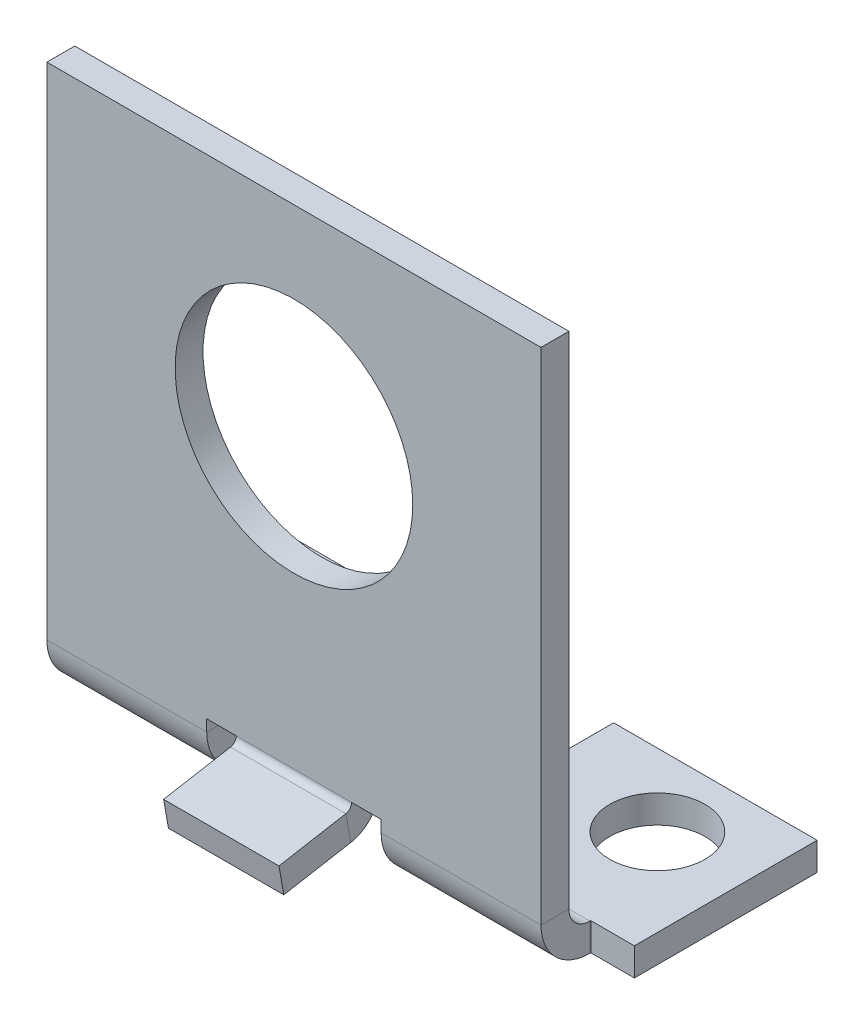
ISO-10303-21;
HEADER;
FILE_DESCRIPTION(('STEP AP214'),'2;1');
FILE_NAME('part.step','',(''),(''),'','','');
FILE_SCHEMA(('AUTOMOTIVE_DESIGN { 1 0 10303 214 1 1 1 1 }'));
ENDSEC;
DATA;
#1=APPLICATION_CONTEXT('core data for automotive mechanical design processes');
#2=APPLICATION_PROTOCOL_DEFINITION('international standard','automotive_design',2000,#1);
#3=PRODUCT_CONTEXT('',#1,'mechanical');
#4=PRODUCT('Part','Part','',(#3));
#5=PRODUCT_RELATED_PRODUCT_CATEGORY('part','',(#4));
#6=PRODUCT_DEFINITION_FORMATION('','',#4);
#7=PRODUCT_DEFINITION_CONTEXT('part definition',#1,'design');
#8=PRODUCT_DEFINITION('design','',#6,#7);
#9=PRODUCT_DEFINITION_SHAPE('','',#8);
#10=(LENGTH_UNIT() NAMED_UNIT(*) SI_UNIT(.MILLI.,.METRE.));
#11=(NAMED_UNIT(*) PLANE_ANGLE_UNIT() SI_UNIT($,.RADIAN.));
#12=(NAMED_UNIT(*) SI_UNIT($,.STERADIAN.) SOLID_ANGLE_UNIT());
#13=UNCERTAINTY_MEASURE_WITH_UNIT(LENGTH_MEASURE(1.E-05),#10,'distance_accuracy_value','');
#14=(GEOMETRIC_REPRESENTATION_CONTEXT(3) GLOBAL_UNCERTAINTY_ASSIGNED_CONTEXT((#13)) GLOBAL_UNIT_ASSIGNED_CONTEXT((#10,
#11,#12)) REPRESENTATION_CONTEXT('',''));
#15=CARTESIAN_POINT('',(0.,0.,0.));
#16=DIRECTION('',(0.,0.,1.));
#17=DIRECTION('',(1.,0.,0.));
#18=AXIS2_PLACEMENT_3D('',#15,#16,#17);
#19=CARTESIAN_POINT('',(0.,3.302,0.));
#20=DIRECTION('',(0.,1.,0.));
#21=DIRECTION('',(0.,0.,1.));
#22=AXIS2_PLACEMENT_3D('',#19,#20,#21);
#23=PLANE('',#22);
#24=DIRECTION('',(0.,0.,-1.));
#25=VECTOR('',#24,1.);
#26=CARTESIAN_POINT('',(-3.1496,3.302,0.));
#27=LINE('',#26,#25);
#28=CARTESIAN_POINT('',(-3.1496,3.302,0.));
#29=VERTEX_POINT('',#28);
#30=CARTESIAN_POINT('',(-3.1496,3.302,-1.524));
#31=VERTEX_POINT('',#30);
#32=EDGE_CURVE('E275',#29,#31,#27,.T.);
#33=ORIENTED_EDGE('',*,*,#32,.F.);
#34=DIRECTION('',(-1.,0.,0.));
#35=VECTOR('',#34,1.);
#36=CARTESIAN_POINT('',(-4.7625,3.302,0.));
#37=LINE('',#36,#35);
#38=CARTESIAN_POINT('',(-4.7625,3.302,0.));
#39=VERTEX_POINT('',#38);
#40=EDGE_CURVE('E323',#29,#39,#37,.T.);
#41=ORIENTED_EDGE('',*,*,#40,.T.);
#42=DIRECTION('',(0.,0.,-1.));
#43=VECTOR('',#42,1.);
#44=CARTESIAN_POINT('',(-4.7625,3.302,-19.05));
#45=LINE('',#44,#43);
#46=CARTESIAN_POINT('',(-4.7625,3.302,-1.52400000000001));
#47=VERTEX_POINT('',#46);
#48=EDGE_CURVE('E336',#39,#47,#45,.T.);
#49=ORIENTED_EDGE('',*,*,#48,.T.);
#50=DIRECTION('',(-1.,0.,0.));
#51=VECTOR('',#50,1.);
#52=CARTESIAN_POINT('',(13.49375,3.302,-1.524));
#53=LINE('',#52,#51);
#54=EDGE_CURVE('E325',#31,#47,#53,.T.);
#55=ORIENTED_EDGE('',*,*,#54,.F.);
#56=EDGE_LOOP('',(#33,#41,#49,#55));
#57=FACE_BOUND('',#56,.T.);
#58=ADVANCED_FACE('F54',(#57),#23,.F.);
#59=CARTESIAN_POINT('',(13.49375,2.667,-2.667));
#60=DIRECTION('',(1.,0.,0.));
#61=DIRECTION('',(0.,0.,-1.));
#62=AXIS2_PLACEMENT_3D('',#59,#60,#61);
#63=PLANE('',#62);
#64=DIRECTION('',(0.,0.,1.));
#65=VECTOR('',#64,1.);
#66=CARTESIAN_POINT('',(13.49375,0.,0.));
#67=LINE('',#66,#65);
#68=CARTESIAN_POINT('',(13.49375,0.,-2.7178));
#69=VERTEX_POINT('',#68);
#70=CARTESIAN_POINT('',(13.49375,0.,-2.667));
#71=VERTEX_POINT('',#70);
#72=EDGE_CURVE('E79',#69,#71,#67,.T.);
#73=ORIENTED_EDGE('',*,*,#72,.F.);
#74=DIRECTION('',(0.,1.,0.));
#75=VECTOR('',#74,1.);
#76=CARTESIAN_POINT('',(13.49375,0.,-2.7178));
#77=LINE('',#76,#75);
#78=CARTESIAN_POINT('',(13.49375,1.524,-2.7178));
#79=VERTEX_POINT('',#78);
#80=EDGE_CURVE('E642',#69,#79,#77,.T.);
#81=ORIENTED_EDGE('',*,*,#80,.T.);
#82=DIRECTION('',(0.,0.,-1.));
#83=VECTOR('',#82,1.);
#84=CARTESIAN_POINT('',(13.49375,1.524,0.));
#85=LINE('',#84,#83);
#86=CARTESIAN_POINT('',(13.49375,1.524,-2.667));
#87=VERTEX_POINT('',#86);
#88=EDGE_CURVE('E405',#79,#87,#85,.F.);
#89=ORIENTED_EDGE('',*,*,#88,.T.);
#90=DIRECTION('',(0.,-1.,0.));
#91=VECTOR('',#90,1.);
#92=CARTESIAN_POINT('',(13.49375,1.524,-2.667));
#93=LINE('',#92,#91);
#94=EDGE_CURVE('E461',#87,#71,#93,.T.);
#95=ORIENTED_EDGE('',*,*,#94,.T.);
#96=EDGE_LOOP('',(#73,#81,#89,#95));
#97=FACE_BOUND('',#96,.T.);
#98=ADVANCED_FACE('F544',(#97),#63,.T.);
#99=CARTESIAN_POINT('',(-4.7625,3.302,-19.05));
#100=DIRECTION('',(-1.,0.,0.));
#101=DIRECTION('',(0.,0.,1.));
#102=AXIS2_PLACEMENT_3D('',#99,#100,#101);
#103=PLANE('',#102);
#104=DIRECTION('',(0.,0.,-1.));
#105=VECTOR('',#104,1.);
#106=CARTESIAN_POINT('',(-4.7625,1.524,0.));
#107=LINE('',#106,#105);
#108=CARTESIAN_POINT('',(-4.7625,1.524,-2.667));
#109=VERTEX_POINT('',#108);
#110=CARTESIAN_POINT('',(-4.7625,1.524,-12.7));
#111=VERTEX_POINT('',#110);
#112=EDGE_CURVE('E357',#109,#111,#107,.T.);
#113=ORIENTED_EDGE('',*,*,#112,.F.);
#114=DIRECTION('',(0.,-1.,0.));
#115=VECTOR('',#114,1.);
#116=CARTESIAN_POINT('',(-4.7625,1.524,-2.667));
#117=LINE('',#116,#115);
#118=CARTESIAN_POINT('',(-4.7625,0.,-2.66700000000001));
#119=VERTEX_POINT('',#118);
#120=EDGE_CURVE('E13',#109,#119,#117,.T.);
#121=ORIENTED_EDGE('',*,*,#120,.T.);
#122=DIRECTION('',(0.,0.,-1.));
#123=VECTOR('',#122,1.);
#124=CARTESIAN_POINT('',(-4.7625,0.,-19.05));
#125=LINE('',#124,#123);
#126=CARTESIAN_POINT('',(-4.7625,0.,-12.7));
#127=VERTEX_POINT('',#126);
#128=EDGE_CURVE('E338',#119,#127,#125,.T.);
#129=ORIENTED_EDGE('',*,*,#128,.T.);
#130=DIRECTION('',(0.,1.,0.));
#131=VECTOR('',#130,1.);
#132=CARTESIAN_POINT('',(-4.7625,1.524,-12.7));
#133=LINE('',#132,#131);
#134=EDGE_CURVE('E361',#127,#111,#133,.T.);
#135=ORIENTED_EDGE('',*,*,#134,.T.);
#136=EDGE_LOOP('',(#113,#121,#129,#135));
#137=FACE_BOUND('',#136,.T.);
#138=ADVANCED_FACE('F549',(#137),#103,.F.);
#139=DIRECTION('',(0.,-1.,0.));
#140=VECTOR('',#139,1.);
#141=CARTESIAN_POINT('',(-4.7625,3.302,0.));
#142=LINE('',#141,#140);
#143=CARTESIAN_POINT('',(-4.7625,2.667,0.));
#144=VERTEX_POINT('',#143);
#145=EDGE_CURVE('E332',#39,#144,#142,.T.);
#146=ORIENTED_EDGE('',*,*,#145,.T.);
#147=DIRECTION('',(0.,0.,-1.));
#148=VECTOR('',#147,1.);
#149=CARTESIAN_POINT('',(-4.7625,2.667,0.));
#150=LINE('',#149,#148);
#151=CARTESIAN_POINT('',(-4.7625,2.667,-1.524));
#152=VERTEX_POINT('',#151);
#153=EDGE_CURVE('E63',#144,#152,#150,.T.);
#154=ORIENTED_EDGE('',*,*,#153,.T.);
#155=DIRECTION('',(0.,-1.,0.));
#156=VECTOR('',#155,1.);
#157=CARTESIAN_POINT('',(-4.7625,0.,-1.524));
#158=LINE('',#157,#156);
#159=EDGE_CURVE('E363',#47,#152,#158,.T.);
#160=ORIENTED_EDGE('',*,*,#159,.F.);
#161=ORIENTED_EDGE('',*,*,#48,.F.);
#162=EDGE_LOOP('',(#146,#154,#160,#161));
#163=FACE_BOUND('',#162,.T.);
#164=ADVANCED_FACE('F477',(#163),#103,.F.);
#165=CARTESIAN_POINT('',(4.7625,3.302,-19.05));
#166=DIRECTION('',(1.,0.,0.));
#167=DIRECTION('',(0.,0.,-1.));
#168=AXIS2_PLACEMENT_3D('',#165,#166,#167);
#169=PLANE('',#168);
#170=DIRECTION('',(0.,1.,0.));
#171=VECTOR('',#170,1.);
#172=CARTESIAN_POINT('',(4.7625,0.,-1.524));
#173=LINE('',#172,#171);
#174=CARTESIAN_POINT('',(4.7625,2.667,-1.524));
#175=VERTEX_POINT('',#174);
#176=CARTESIAN_POINT('',(4.7625,3.302,-1.524));
#177=VERTEX_POINT('',#176);
#178=EDGE_CURVE('E374',#175,#177,#173,.T.);
#179=ORIENTED_EDGE('',*,*,#178,.F.);
#180=DIRECTION('',(0.,0.,1.));
#181=VECTOR('',#180,1.);
#182=CARTESIAN_POINT('',(4.7625,2.667,-1.524));
#183=LINE('',#182,#181);
#184=CARTESIAN_POINT('',(4.7625,2.667,0.));
#185=VERTEX_POINT('',#184);
#186=EDGE_CURVE('E473',#175,#185,#183,.T.);
#187=ORIENTED_EDGE('',*,*,#186,.T.);
#188=DIRECTION('',(0.,-1.,0.));
#189=VECTOR('',#188,1.);
#190=CARTESIAN_POINT('',(4.7625,3.302,0.));
#191=LINE('',#190,#189);
#192=CARTESIAN_POINT('',(4.7625,3.302,0.));
#193=VERTEX_POINT('',#192);
#194=EDGE_CURVE('E350',#193,#185,#191,.T.);
#195=ORIENTED_EDGE('',*,*,#194,.F.);
#196=DIRECTION('',(0.,0.,1.));
#197=VECTOR('',#196,1.);
#198=CARTESIAN_POINT('',(4.7625,3.302,-19.05));
#199=LINE('',#198,#197);
#200=EDGE_CURVE('E334',#177,#193,#199,.T.);
#201=ORIENTED_EDGE('',*,*,#200,.F.);
#202=EDGE_LOOP('',(#179,#187,#195,#201));
#203=FACE_BOUND('',#202,.T.);
#204=ADVANCED_FACE('F524',(#203),#169,.F.);
#205=DIRECTION('',(0.,0.,1.));
#206=VECTOR('',#205,1.);
#207=CARTESIAN_POINT('',(4.7625,0.,-19.05));
#208=LINE('',#207,#206);
#209=CARTESIAN_POINT('',(4.7625,0.,-12.7));
#210=VERTEX_POINT('',#209);
#211=CARTESIAN_POINT('',(4.7625,0.,-2.667));
#212=VERTEX_POINT('',#211);
#213=EDGE_CURVE('E351',#210,#212,#208,.T.);
#214=ORIENTED_EDGE('',*,*,#213,.T.);
#215=DIRECTION('',(0.,1.,0.));
#216=VECTOR('',#215,1.);
#217=CARTESIAN_POINT('',(4.7625,0.,-2.667));
#218=LINE('',#217,#216);
#219=CARTESIAN_POINT('',(4.7625,1.524,-2.667));
#220=VERTEX_POINT('',#219);
#221=EDGE_CURVE('E471',#212,#220,#218,.T.);
#222=ORIENTED_EDGE('',*,*,#221,.T.);
#223=DIRECTION('',(0.,0.,1.));
#224=VECTOR('',#223,1.);
#225=CARTESIAN_POINT('',(4.7625,1.524,0.));
#226=LINE('',#225,#224);
#227=CARTESIAN_POINT('',(4.76250000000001,1.524,-12.7));
#228=VERTEX_POINT('',#227);
#229=EDGE_CURVE('E369',#228,#220,#226,.T.);
#230=ORIENTED_EDGE('',*,*,#229,.F.);
#231=DIRECTION('',(0.,-1.,0.));
#232=VECTOR('',#231,1.);
#233=CARTESIAN_POINT('',(4.7625,1.524,-12.7));
#234=LINE('',#233,#232);
#235=EDGE_CURVE('E372',#228,#210,#234,.T.);
#236=ORIENTED_EDGE('',*,*,#235,.T.);
#237=EDGE_LOOP('',(#214,#222,#230,#236));
#238=FACE_BOUND('',#237,.T.);
#239=ADVANCED_FACE('F562',(#238),#169,.F.);
#240=CARTESIAN_POINT('',(13.49375,2.667,-2.667));
#241=DIRECTION('',(-1.,0.,0.));
#242=DIRECTION('',(0.,0.,1.));
#243=AXIS2_PLACEMENT_3D('',#240,#241,#242);
#244=CYLINDRICAL_SURFACE('',#243,2.667);
#245=CARTESIAN_POINT('',(4.7625,2.667,-2.667));
#246=DIRECTION('',(1.,0.,0.));
#247=DIRECTION('',(0.,0.,-1.));
#248=AXIS2_PLACEMENT_3D('',#245,#246,#247);
#249=CIRCLE('',#248,2.667);
#250=EDGE_CURVE('E377',#212,#185,#249,.F.);
#251=ORIENTED_EDGE('',*,*,#250,.F.);
#252=DIRECTION('',(-1.,0.,0.));
#253=VECTOR('',#252,1.);
#254=CARTESIAN_POINT('',(13.49375,0.,-2.667));
#255=LINE('',#254,#253);
#256=EDGE_CURVE('E444',#71,#212,#255,.T.);
#257=ORIENTED_EDGE('',*,*,#256,.F.);
#258=CARTESIAN_POINT('',(13.49375,2.667,-2.667));
#259=DIRECTION('',(1.,0.,0.));
#260=DIRECTION('',(0.,0.,-1.));
#261=AXIS2_PLACEMENT_3D('',#258,#259,#260);
#262=CIRCLE('',#261,2.667);
#263=CARTESIAN_POINT('',(13.49375,2.667,0.));
#264=VERTEX_POINT('',#263);
#265=EDGE_CURVE('E401',#71,#264,#262,.F.);
#266=ORIENTED_EDGE('',*,*,#265,.T.);
#267=DIRECTION('',(-1.,0.,0.));
#268=VECTOR('',#267,1.);
#269=CARTESIAN_POINT('',(13.49375,2.667,0.));
#270=LINE('',#269,#268);
#271=EDGE_CURVE('E448',#264,#185,#270,.T.);
#272=ORIENTED_EDGE('',*,*,#271,.T.);
#273=EDGE_LOOP('',(#251,#257,#266,#272));
#274=FACE_BOUND('',#273,.T.);
#275=ADVANCED_FACE('F510',(#274),#244,.T.);
#276=CARTESIAN_POINT('',(13.49375,0.,0.));
#277=DIRECTION('',(0.,-1.,0.));
#278=DIRECTION('',(0.,0.,-1.));
#279=AXIS2_PLACEMENT_3D('',#276,#277,#278);
#280=PLANE('',#279);
#281=CARTESIAN_POINT('',(11.1125,0.,-8.7376));
#282=DIRECTION('',(0.,1.,0.));
#283=DIRECTION('',(0.,0.,1.));
#284=AXIS2_PLACEMENT_3D('',#281,#282,#283);
#285=CIRCLE('',#284,2.6035);
#286=CARTESIAN_POINT('',(11.1125,0.,-6.1341));
#287=VERTEX_POINT('',#286);
#288=EDGE_CURVE('E1068',#287,#287,#285,.T.);
#289=ORIENTED_EDGE('',*,*,#288,.T.);
#290=EDGE_LOOP('',(#289));
#291=FACE_BOUND('',#290,.T.);
#292=ORIENTED_EDGE('',*,*,#213,.F.);
#293=DIRECTION('',(-1.,0.,0.));
#294=VECTOR('',#293,1.);
#295=CARTESIAN_POINT('',(13.49375,0.,-12.7));
#296=LINE('',#295,#294);
#297=CARTESIAN_POINT('',(15.875,0.,-12.7));
#298=VERTEX_POINT('',#297);
#299=EDGE_CURVE('E440',#298,#210,#296,.T.);
#300=ORIENTED_EDGE('',*,*,#299,.F.);
#301=DIRECTION('',(0.,0.,1.));
#302=VECTOR('',#301,1.);
#303=CARTESIAN_POINT('',(15.875,0.,-12.7));
#304=LINE('',#303,#302);
#305=CARTESIAN_POINT('',(15.875,0.,-2.7178));
#306=VERTEX_POINT('',#305);
#307=EDGE_CURVE('E635',#298,#306,#304,.T.);
#308=ORIENTED_EDGE('',*,*,#307,.T.);
#309=DIRECTION('',(-1.,0.,0.));
#310=VECTOR('',#309,1.);
#311=CARTESIAN_POINT('',(13.49375,0.,-2.7178));
#312=LINE('',#311,#310);
#313=EDGE_CURVE('E1071',#306,#69,#312,.T.);
#314=ORIENTED_EDGE('',*,*,#313,.T.);
#315=ORIENTED_EDGE('',*,*,#72,.T.);
#316=ORIENTED_EDGE('',*,*,#256,.T.);
#317=EDGE_LOOP('',(#292,#300,#308,#314,#315,#316));
#318=FACE_BOUND('',#317,.T.);
#319=ADVANCED_FACE('F588',(#291,#318),#280,.T.);
#320=CARTESIAN_POINT('',(13.49375,1.524,-12.7));
#321=DIRECTION('',(0.,0.,-1.));
#322=DIRECTION('',(0.,1.,0.));
#323=AXIS2_PLACEMENT_3D('',#320,#321,#322);
#324=PLANE('',#323);
#325=ORIENTED_EDGE('',*,*,#235,.F.);
#326=DIRECTION('',(-1.,0.,0.));
#327=VECTOR('',#326,1.);
#328=CARTESIAN_POINT('',(13.49375,1.524,-12.7));
#329=LINE('',#328,#327);
#330=CARTESIAN_POINT('',(15.875,1.524,-12.7));
#331=VERTEX_POINT('',#330);
#332=EDGE_CURVE('E436',#331,#228,#329,.T.);
#333=ORIENTED_EDGE('',*,*,#332,.F.);
#334=DIRECTION('',(0.,1.,0.));
#335=VECTOR('',#334,1.);
#336=CARTESIAN_POINT('',(15.875,0.,-12.7));
#337=LINE('',#336,#335);
#338=EDGE_CURVE('E629',#298,#331,#337,.T.);
#339=ORIENTED_EDGE('',*,*,#338,.F.);
#340=ORIENTED_EDGE('',*,*,#299,.T.);
#341=EDGE_LOOP('',(#325,#333,#339,#340));
#342=FACE_BOUND('',#341,.T.);
#343=ADVANCED_FACE('F583',(#342),#324,.T.);
#344=CARTESIAN_POINT('',(13.49375,1.524,0.));
#345=DIRECTION('',(0.,-1.,0.));
#346=DIRECTION('',(0.,0.,-1.));
#347=AXIS2_PLACEMENT_3D('',#344,#345,#346);
#348=PLANE('',#347);
#349=CARTESIAN_POINT('',(11.1125,1.524,-8.7376));
#350=DIRECTION('',(0.,1.,0.));
#351=DIRECTION('',(0.,0.,1.));
#352=AXIS2_PLACEMENT_3D('',#349,#350,#351);
#353=CIRCLE('',#352,2.6035);
#354=CARTESIAN_POINT('',(11.1125,1.524,-6.1341));
#355=VERTEX_POINT('',#354);
#356=EDGE_CURVE('E622',#355,#355,#353,.T.);
#357=ORIENTED_EDGE('',*,*,#356,.F.);
#358=EDGE_LOOP('',(#357));
#359=FACE_BOUND('',#358,.T.);
#360=ORIENTED_EDGE('',*,*,#332,.T.);
#361=ORIENTED_EDGE('',*,*,#229,.T.);
#362=DIRECTION('',(-1.,0.,0.));
#363=VECTOR('',#362,1.);
#364=CARTESIAN_POINT('',(13.49375,1.524,-2.667));
#365=LINE('',#364,#363);
#366=EDGE_CURVE('E432',#87,#220,#365,.T.);
#367=ORIENTED_EDGE('',*,*,#366,.F.);
#368=ORIENTED_EDGE('',*,*,#88,.F.);
#369=DIRECTION('',(-1.,0.,0.));
#370=VECTOR('',#369,1.);
#371=CARTESIAN_POINT('',(13.49375,1.524,-2.7178));
#372=LINE('',#371,#370);
#373=CARTESIAN_POINT('',(15.875,1.524,-2.7178));
#374=VERTEX_POINT('',#373);
#375=EDGE_CURVE('E1074',#374,#79,#372,.T.);
#376=ORIENTED_EDGE('',*,*,#375,.F.);
#377=DIRECTION('',(0.,0.,1.));
#378=VECTOR('',#377,1.);
#379=CARTESIAN_POINT('',(15.875,1.524,-12.7));
#380=LINE('',#379,#378);
#381=EDGE_CURVE('E625',#331,#374,#380,.T.);
#382=ORIENTED_EDGE('',*,*,#381,.F.);
#383=EDGE_LOOP('',(#360,#361,#367,#368,#376,#382));
#384=FACE_BOUND('',#383,.T.);
#385=ADVANCED_FACE('F578',(#359,#384),#348,.F.);
#386=CARTESIAN_POINT('',(13.49375,2.667,-2.667));
#387=DIRECTION('',(-1.,0.,0.));
#388=DIRECTION('',(0.,0.,1.));
#389=AXIS2_PLACEMENT_3D('',#386,#387,#388);
#390=CYLINDRICAL_SURFACE('',#389,1.143);
#391=ORIENTED_EDGE('',*,*,#366,.T.);
#392=CARTESIAN_POINT('',(4.7625,2.667,-2.667));
#393=DIRECTION('',(1.,0.,0.));
#394=DIRECTION('',(0.,0.,-1.));
#395=AXIS2_PLACEMENT_3D('',#392,#393,#394);
#396=CIRCLE('',#395,1.143);
#397=EDGE_CURVE('E468',#220,#175,#396,.F.);
#398=ORIENTED_EDGE('',*,*,#397,.T.);
#399=DIRECTION('',(-1.,0.,0.));
#400=VECTOR('',#399,1.);
#401=CARTESIAN_POINT('',(13.49375,2.667,-1.524));
#402=LINE('',#401,#400);
#403=CARTESIAN_POINT('',(13.49375,2.667,-1.524));
#404=VERTEX_POINT('',#403);
#405=EDGE_CURVE('E428',#404,#175,#402,.T.);
#406=ORIENTED_EDGE('',*,*,#405,.F.);
#407=CARTESIAN_POINT('',(13.49375,2.667,-2.667));
#408=DIRECTION('',(1.,0.,0.));
#409=DIRECTION('',(0.,0.,-1.));
#410=AXIS2_PLACEMENT_3D('',#407,#408,#409);
#411=CIRCLE('',#410,1.143);
#412=EDGE_CURVE('E407',#87,#404,#411,.F.);
#413=ORIENTED_EDGE('',*,*,#412,.F.);
#414=EDGE_LOOP('',(#391,#398,#406,#413));
#415=FACE_BOUND('',#414,.T.);
#416=ADVANCED_FACE('F519',(#415),#390,.F.);
#417=CARTESIAN_POINT('',(13.49375,2.667,0.));
#418=DIRECTION('',(1.,0.,0.));
#419=DIRECTION('',(0.,0.,-1.));
#420=AXIS2_PLACEMENT_3D('',#417,#418,#419);
#421=PLANE('',#420);
#422=DIRECTION('',(0.,0.,-1.));
#423=VECTOR('',#422,1.);
#424=CARTESIAN_POINT('',(13.49375,2.667,0.));
#425=LINE('',#424,#423);
#426=EDGE_CURVE('E463',#264,#404,#425,.T.);
#427=ORIENTED_EDGE('',*,*,#426,.F.);
#428=ORIENTED_EDGE('',*,*,#265,.F.);
#429=ORIENTED_EDGE('',*,*,#94,.F.);
#430=ORIENTED_EDGE('',*,*,#412,.T.);
#431=EDGE_LOOP('',(#427,#428,#429,#430));
#432=FACE_BOUND('',#431,.T.);
#433=ADVANCED_FACE('F56',(#432),#421,.T.);
#434=CARTESIAN_POINT('',(13.49375,1.524,-2.667));
#435=DIRECTION('',(1.,0.,0.));
#436=DIRECTION('',(0.,0.,-1.));
#437=AXIS2_PLACEMENT_3D('',#434,#435,#436);
#438=PLANE('',#437);
#439=DIRECTION('',(0.,1.,0.));
#440=VECTOR('',#439,1.);
#441=CARTESIAN_POINT('',(13.49375,0.,0.));
#442=LINE('',#441,#440);
#443=CARTESIAN_POINT('',(13.49375,29.9974,0.));
#444=VERTEX_POINT('',#443);
#445=EDGE_CURVE('E398',#264,#444,#442,.T.);
#446=ORIENTED_EDGE('',*,*,#445,.F.);
#447=ORIENTED_EDGE('',*,*,#426,.T.);
#448=DIRECTION('',(0.,1.,0.));
#449=VECTOR('',#448,1.);
#450=CARTESIAN_POINT('',(13.49375,0.,-1.524));
#451=LINE('',#450,#449);
#452=CARTESIAN_POINT('',(13.49375,29.9974,-1.524));
#453=VERTEX_POINT('',#452);
#454=EDGE_CURVE('E392',#404,#453,#451,.T.);
#455=ORIENTED_EDGE('',*,*,#454,.T.);
#456=DIRECTION('',(0.,0.,-1.));
#457=VECTOR('',#456,1.);
#458=CARTESIAN_POINT('',(13.49375,29.9974,0.));
#459=LINE('',#458,#457);
#460=EDGE_CURVE('E394',#444,#453,#459,.T.);
#461=ORIENTED_EDGE('',*,*,#460,.F.);
#462=EDGE_LOOP('',(#446,#447,#455,#461));
#463=FACE_BOUND('',#462,.T.);
#464=ADVANCED_FACE('F505',(#463),#438,.T.);
#465=CARTESIAN_POINT('',(-13.49375,0.,-2.667));
#466=DIRECTION('',(-1.,0.,0.));
#467=DIRECTION('',(0.,0.,1.));
#468=AXIS2_PLACEMENT_3D('',#465,#466,#467);
#469=PLANE('',#468);
#470=DIRECTION('',(0.,1.,0.));
#471=VECTOR('',#470,1.);
#472=CARTESIAN_POINT('',(-13.49375,0.,-2.667));
#473=LINE('',#472,#471);
#474=CARTESIAN_POINT('',(-13.49375,0.,-2.667));
#475=VERTEX_POINT('',#474);
#476=CARTESIAN_POINT('',(-13.49375,1.524,-2.667));
#477=VERTEX_POINT('',#476);
#478=EDGE_CURVE('E458',#475,#477,#473,.T.);
#479=ORIENTED_EDGE('',*,*,#478,.F.);
#480=CARTESIAN_POINT('',(-13.49375,2.667,-2.667));
#481=DIRECTION('',(1.,0.,0.));
#482=DIRECTION('',(0.,0.,-1.));
#483=AXIS2_PLACEMENT_3D('',#480,#481,#482);
#484=CIRCLE('',#483,2.667);
#485=CARTESIAN_POINT('',(-13.49375,2.667,0.));
#486=VERTEX_POINT('',#485);
#487=EDGE_CURVE('E419',#475,#486,#484,.F.);
#488=ORIENTED_EDGE('',*,*,#487,.T.);
#489=DIRECTION('',(0.,0.,1.));
#490=VECTOR('',#489,1.);
#491=CARTESIAN_POINT('',(-13.49375,2.667,-1.524));
#492=LINE('',#491,#490);
#493=CARTESIAN_POINT('',(-13.49375,2.667,-1.524));
#494=VERTEX_POINT('',#493);
#495=EDGE_CURVE('E455',#494,#486,#492,.T.);
#496=ORIENTED_EDGE('',*,*,#495,.F.);
#497=CARTESIAN_POINT('',(-13.49375,2.667,-2.667));
#498=DIRECTION('',(1.,0.,0.));
#499=DIRECTION('',(0.,0.,-1.));
#500=AXIS2_PLACEMENT_3D('',#497,#498,#499);
#501=CIRCLE('',#500,1.143);
#502=EDGE_CURVE('E395',#477,#494,#501,.F.);
#503=ORIENTED_EDGE('',*,*,#502,.F.);
#504=EDGE_LOOP('',(#479,#488,#496,#503));
#505=FACE_BOUND('',#504,.T.);
#506=ADVANCED_FACE('F601',(#505),#469,.T.);
#507=CARTESIAN_POINT('',(-13.49375,2.667,-1.524));
#508=DIRECTION('',(-1.,0.,0.));
#509=DIRECTION('',(0.,0.,1.));
#510=AXIS2_PLACEMENT_3D('',#507,#508,#509);
#511=PLANE('',#510);
#512=DIRECTION('',(0.,1.,0.));
#513=VECTOR('',#512,1.);
#514=CARTESIAN_POINT('',(-13.49375,0.,-2.7178));
#515=LINE('',#514,#513);
#516=CARTESIAN_POINT('',(-13.49375,0.,-2.7178));
#517=VERTEX_POINT('',#516);
#518=CARTESIAN_POINT('',(-13.49375,1.524,-2.7178));
#519=VERTEX_POINT('',#518);
#520=EDGE_CURVE('E354',#517,#519,#515,.T.);
#521=ORIENTED_EDGE('',*,*,#520,.F.);
#522=DIRECTION('',(0.,0.,1.));
#523=VECTOR('',#522,1.);
#524=CARTESIAN_POINT('',(-13.49375,0.,0.));
#525=LINE('',#524,#523);
#526=EDGE_CURVE('E422',#517,#475,#525,.T.);
#527=ORIENTED_EDGE('',*,*,#526,.T.);
#528=ORIENTED_EDGE('',*,*,#478,.T.);
#529=DIRECTION('',(0.,0.,-1.));
#530=VECTOR('',#529,1.);
#531=CARTESIAN_POINT('',(-13.49375,1.524,0.));
#532=LINE('',#531,#530);
#533=EDGE_CURVE('E424',#519,#477,#532,.F.);
#534=ORIENTED_EDGE('',*,*,#533,.F.);
#535=EDGE_LOOP('',(#521,#527,#528,#534));
#536=FACE_BOUND('',#535,.T.);
#537=ADVANCED_FACE('F598',(#536),#511,.T.);
#538=CARTESIAN_POINT('',(13.49375,0.,-1.524));
#539=DIRECTION('',(0.,0.,1.));
#540=DIRECTION('',(1.,0.,0.));
#541=AXIS2_PLACEMENT_3D('',#538,#539,#540);
#542=PLANE('',#541);
#543=ORIENTED_EDGE('',*,*,#405,.T.);
#544=ORIENTED_EDGE('',*,*,#178,.T.);
#545=CARTESIAN_POINT('',(3.1496,3.302,-1.524));
#546=VERTEX_POINT('',#545);
#547=EDGE_CURVE('E342',#177,#546,#53,.T.);
#548=ORIENTED_EDGE('',*,*,#547,.T.);
#549=DIRECTION('',(1.,0.,0.));
#550=VECTOR('',#549,1.);
#551=CARTESIAN_POINT('',(3.1496,3.302,-1.524));
#552=LINE('',#551,#550);
#553=EDGE_CURVE('E289',#546,#31,#552,.F.);
#554=ORIENTED_EDGE('',*,*,#553,.T.);
#555=ORIENTED_EDGE('',*,*,#54,.T.);
#556=ORIENTED_EDGE('',*,*,#159,.T.);
#557=EDGE_CURVE('E410',#152,#494,#402,.T.);
#558=ORIENTED_EDGE('',*,*,#557,.T.);
#559=DIRECTION('',(0.,1.,0.));
#560=VECTOR('',#559,1.);
#561=CARTESIAN_POINT('',(-13.49375,0.,-1.524));
#562=LINE('',#561,#560);
#563=CARTESIAN_POINT('',(-13.49375,29.9974,-1.524));
#564=VERTEX_POINT('',#563);
#565=EDGE_CURVE('E390',#494,#564,#562,.T.);
#566=ORIENTED_EDGE('',*,*,#565,.T.);
#567=DIRECTION('',(-1.,0.,0.));
#568=VECTOR('',#567,1.);
#569=CARTESIAN_POINT('',(13.49375,29.9974,-1.524));
#570=LINE('',#569,#568);
#571=EDGE_CURVE('E453',#453,#564,#570,.T.);
#572=ORIENTED_EDGE('',*,*,#571,.F.);
#573=ORIENTED_EDGE('',*,*,#454,.F.);
#574=EDGE_LOOP('',(#543,#544,#548,#554,#555,#556,#558,#566,#572,#573));
#575=FACE_BOUND('',#574,.T.);
#576=CARTESIAN_POINT('',(0.,19.05,-1.524));
#577=DIRECTION('',(0.,0.,1.));
#578=DIRECTION('',(1.,0.,0.));
#579=AXIS2_PLACEMENT_3D('',#576,#577,#578);
#580=CIRCLE('',#579,6.4897);
#581=CARTESIAN_POINT('',(6.4897,19.05,-1.524));
#582=VERTEX_POINT('',#581);
#583=EDGE_CURVE('E381',#582,#582,#580,.T.);
#584=ORIENTED_EDGE('',*,*,#583,.T.);
#585=EDGE_LOOP('',(#584));
#586=FACE_BOUND('',#585,.T.);
#587=ADVANCED_FACE('F486',(#575,#586),#542,.F.);
#588=CARTESIAN_POINT('',(13.49375,29.9974,0.));
#589=DIRECTION('',(0.,1.,0.));
#590=DIRECTION('',(0.,0.,1.));
#591=AXIS2_PLACEMENT_3D('',#588,#589,#590);
#592=PLANE('',#591);
#593=DIRECTION('',(0.,0.,-1.));
#594=VECTOR('',#593,1.);
#595=CARTESIAN_POINT('',(-13.49375,29.9974,0.));
#596=LINE('',#595,#594);
#597=CARTESIAN_POINT('',(-13.49375,29.9974,0.));
#598=VERTEX_POINT('',#597);
#599=EDGE_CURVE('E413',#598,#564,#596,.T.);
#600=ORIENTED_EDGE('',*,*,#599,.F.);
#601=DIRECTION('',(-1.,0.,0.));
#602=VECTOR('',#601,1.);
#603=CARTESIAN_POINT('',(13.49375,29.9974,0.));
#604=LINE('',#603,#602);
#605=EDGE_CURVE('E451',#444,#598,#604,.T.);
#606=ORIENTED_EDGE('',*,*,#605,.F.);
#607=ORIENTED_EDGE('',*,*,#460,.T.);
#608=ORIENTED_EDGE('',*,*,#571,.T.);
#609=EDGE_LOOP('',(#600,#606,#607,#608));
#610=FACE_BOUND('',#609,.T.);
#611=ADVANCED_FACE('F502',(#610),#592,.T.);
#612=CARTESIAN_POINT('',(13.49375,0.,0.));
#613=DIRECTION('',(0.,0.,1.));
#614=DIRECTION('',(1.,0.,0.));
#615=AXIS2_PLACEMENT_3D('',#612,#613,#614);
#616=PLANE('',#615);
#617=ORIENTED_EDGE('',*,*,#194,.T.);
#618=ORIENTED_EDGE('',*,*,#271,.F.);
#619=ORIENTED_EDGE('',*,*,#445,.T.);
#620=ORIENTED_EDGE('',*,*,#605,.T.);
#621=DIRECTION('',(0.,1.,0.));
#622=VECTOR('',#621,1.);
#623=CARTESIAN_POINT('',(-13.49375,0.,0.));
#624=LINE('',#623,#622);
#625=EDGE_CURVE('E416',#486,#598,#624,.T.);
#626=ORIENTED_EDGE('',*,*,#625,.F.);
#627=EDGE_CURVE('E447',#144,#486,#270,.T.);
#628=ORIENTED_EDGE('',*,*,#627,.F.);
#629=ORIENTED_EDGE('',*,*,#145,.F.);
#630=ORIENTED_EDGE('',*,*,#40,.F.);
#631=DIRECTION('',(1.,0.,0.));
#632=VECTOR('',#631,1.);
#633=CARTESIAN_POINT('',(3.1496,3.302,0.));
#634=LINE('',#633,#632);
#635=CARTESIAN_POINT('',(3.1496,3.302,0.));
#636=VERTEX_POINT('',#635);
#637=EDGE_CURVE('E285',#636,#29,#634,.F.);
#638=ORIENTED_EDGE('',*,*,#637,.F.);
#639=EDGE_CURVE('E333',#193,#636,#37,.T.);
#640=ORIENTED_EDGE('',*,*,#639,.F.);
#641=EDGE_LOOP('',(#617,#618,#619,#620,#626,#628,#629,#630,#638,#640));
#642=FACE_BOUND('',#641,.T.);
#643=CARTESIAN_POINT('',(0.,19.05,0.));
#644=DIRECTION('',(0.,0.,1.));
#645=DIRECTION('',(1.,0.,0.));
#646=AXIS2_PLACEMENT_3D('',#643,#644,#645);
#647=CIRCLE('',#646,6.4897);
#648=CARTESIAN_POINT('',(6.4897,19.05,0.));
#649=VERTEX_POINT('',#648);
#650=EDGE_CURVE('E385',#649,#649,#647,.T.);
#651=ORIENTED_EDGE('',*,*,#650,.F.);
#652=EDGE_LOOP('',(#651));
#653=FACE_BOUND('',#652,.T.);
#654=ADVANCED_FACE('F328',(#642,#653),#616,.T.);
#655=CARTESIAN_POINT('',(-4.7625,2.667,-2.667));
#656=DIRECTION('',(-1.,0.,0.));
#657=DIRECTION('',(0.,0.,1.));
#658=AXIS2_PLACEMENT_3D('',#655,#656,#657);
#659=CIRCLE('',#658,2.667);
#660=EDGE_CURVE('E366',#144,#119,#659,.F.);
#661=ORIENTED_EDGE('',*,*,#660,.F.);
#662=ORIENTED_EDGE('',*,*,#627,.T.);
#663=ORIENTED_EDGE('',*,*,#487,.F.);
#664=EDGE_CURVE('E443',#119,#475,#255,.T.);
#665=ORIENTED_EDGE('',*,*,#664,.F.);
#666=EDGE_LOOP('',(#661,#662,#663,#665));
#667=FACE_BOUND('',#666,.T.);
#668=ADVANCED_FACE('F586',(#667),#244,.T.);
#669=CARTESIAN_POINT('',(-11.1125,0.,-8.7376));
#670=DIRECTION('',(0.,1.,0.));
#671=DIRECTION('',(0.,0.,1.));
#672=AXIS2_PLACEMENT_3D('',#669,#670,#671);
#673=CIRCLE('',#672,2.6035);
#674=CARTESIAN_POINT('',(-11.1125,0.,-6.1341));
#675=VERTEX_POINT('',#674);
#676=EDGE_CURVE('E1079',#675,#675,#673,.T.);
#677=ORIENTED_EDGE('',*,*,#676,.T.);
#678=EDGE_LOOP('',(#677));
#679=FACE_BOUND('',#678,.T.);
#680=ORIENTED_EDGE('',*,*,#128,.F.);
#681=ORIENTED_EDGE('',*,*,#664,.T.);
#682=ORIENTED_EDGE('',*,*,#526,.F.);
#683=DIRECTION('',(1.,0.,0.));
#684=VECTOR('',#683,1.);
#685=CARTESIAN_POINT('',(-13.49375,0.,-2.7178));
#686=LINE('',#685,#684);
#687=CARTESIAN_POINT('',(-15.875,0.,-2.7178));
#688=VERTEX_POINT('',#687);
#689=EDGE_CURVE('E651',#688,#517,#686,.T.);
#690=ORIENTED_EDGE('',*,*,#689,.F.);
#691=DIRECTION('',(0.,0.,1.));
#692=VECTOR('',#691,1.);
#693=CARTESIAN_POINT('',(-15.875,0.,-12.7));
#694=LINE('',#693,#692);
#695=CARTESIAN_POINT('',(-15.875,0.,-12.7));
#696=VERTEX_POINT('',#695);
#697=EDGE_CURVE('E648',#696,#688,#694,.T.);
#698=ORIENTED_EDGE('',*,*,#697,.F.);
#699=EDGE_CURVE('E439',#127,#696,#296,.T.);
#700=ORIENTED_EDGE('',*,*,#699,.F.);
#701=EDGE_LOOP('',(#680,#681,#682,#690,#698,#700));
#702=FACE_BOUND('',#701,.T.);
#703=ADVANCED_FACE('F581',(#679,#702),#280,.T.);
#704=ORIENTED_EDGE('',*,*,#134,.F.);
#705=ORIENTED_EDGE('',*,*,#699,.T.);
#706=DIRECTION('',(0.,1.,0.));
#707=VECTOR('',#706,1.);
#708=CARTESIAN_POINT('',(-15.875,0.,-12.7));
#709=LINE('',#708,#707);
#710=CARTESIAN_POINT('',(-15.875,1.524,-12.7));
#711=VERTEX_POINT('',#710);
#712=EDGE_CURVE('E652',#696,#711,#709,.T.);
#713=ORIENTED_EDGE('',*,*,#712,.T.);
#714=EDGE_CURVE('E435',#111,#711,#329,.T.);
#715=ORIENTED_EDGE('',*,*,#714,.F.);
#716=EDGE_LOOP('',(#704,#705,#713,#715));
#717=FACE_BOUND('',#716,.T.);
#718=ADVANCED_FACE('F576',(#717),#324,.T.);
#719=CARTESIAN_POINT('',(-11.1125,1.524,-8.7376));
#720=DIRECTION('',(0.,1.,0.));
#721=DIRECTION('',(0.,0.,1.));
#722=AXIS2_PLACEMENT_3D('',#719,#720,#721);
#723=CIRCLE('',#722,2.6035);
#724=CARTESIAN_POINT('',(-11.1125,1.524,-6.1341));
#725=VERTEX_POINT('',#724);
#726=EDGE_CURVE('E278',#725,#725,#723,.T.);
#727=ORIENTED_EDGE('',*,*,#726,.F.);
#728=EDGE_LOOP('',(#727));
#729=FACE_BOUND('',#728,.T.);
#730=EDGE_CURVE('E431',#109,#477,#365,.T.);
#731=ORIENTED_EDGE('',*,*,#730,.F.);
#732=ORIENTED_EDGE('',*,*,#112,.T.);
#733=ORIENTED_EDGE('',*,*,#714,.T.);
#734=DIRECTION('',(0.,0.,1.));
#735=VECTOR('',#734,1.);
#736=CARTESIAN_POINT('',(-15.875,1.524,-12.7));
#737=LINE('',#736,#735);
#738=CARTESIAN_POINT('',(-15.875,1.524,-2.7178));
#739=VERTEX_POINT('',#738);
#740=EDGE_CURVE('E636',#711,#739,#737,.T.);
#741=ORIENTED_EDGE('',*,*,#740,.T.);
#742=DIRECTION('',(1.,0.,0.));
#743=VECTOR('',#742,1.);
#744=CARTESIAN_POINT('',(-13.49375,1.524,-2.7178));
#745=LINE('',#744,#743);
#746=EDGE_CURVE('E640',#739,#519,#745,.T.);
#747=ORIENTED_EDGE('',*,*,#746,.T.);
#748=ORIENTED_EDGE('',*,*,#533,.T.);
#749=EDGE_LOOP('',(#731,#732,#733,#741,#747,#748));
#750=FACE_BOUND('',#749,.T.);
#751=ADVANCED_FACE('F573',(#729,#750),#348,.F.);
#752=ORIENTED_EDGE('',*,*,#557,.F.);
#753=CARTESIAN_POINT('',(-4.7625,2.667,-2.667));
#754=DIRECTION('',(-1.,0.,0.));
#755=DIRECTION('',(0.,0.,1.));
#756=AXIS2_PLACEMENT_3D('',#753,#754,#755);
#757=CIRCLE('',#756,1.143);
#758=EDGE_CURVE('E465',#152,#109,#757,.F.);
#759=ORIENTED_EDGE('',*,*,#758,.T.);
#760=ORIENTED_EDGE('',*,*,#730,.T.);
#761=ORIENTED_EDGE('',*,*,#502,.T.);
#762=EDGE_LOOP('',(#752,#759,#760,#761));
#763=FACE_BOUND('',#762,.T.);
#764=ADVANCED_FACE('F489',(#763),#390,.F.);
#765=CARTESIAN_POINT('',(-13.49375,2.667,-2.667));
#766=DIRECTION('',(1.,0.,0.));
#767=DIRECTION('',(0.,0.,-1.));
#768=AXIS2_PLACEMENT_3D('',#765,#766,#767);
#769=PLANE('',#768);
#770=ORIENTED_EDGE('',*,*,#565,.F.);
#771=ORIENTED_EDGE('',*,*,#495,.T.);
#772=ORIENTED_EDGE('',*,*,#625,.T.);
#773=ORIENTED_EDGE('',*,*,#599,.T.);
#774=EDGE_LOOP('',(#770,#771,#772,#773));
#775=FACE_BOUND('',#774,.T.);
#776=ADVANCED_FACE('F495',(#775),#769,.F.);
#777=CARTESIAN_POINT('',(0.,19.05,-1.524));
#778=DIRECTION('',(0.,0.,1.));
#779=DIRECTION('',(1.,0.,0.));
#780=AXIS2_PLACEMENT_3D('',#777,#778,#779);
#781=CYLINDRICAL_SURFACE('',#780,6.4897);
#782=CARTESIAN_POINT('',(6.4897,19.05,-1.524));
#783=CARTESIAN_POINT('',(6.4897,19.05,-1.508125));
#784=CARTESIAN_POINT('',(6.4897,19.05,-1.49225));
#785=CARTESIAN_POINT('',(6.4897,19.05,-1.4605));
#786=CARTESIAN_POINT('',(6.4897,19.05,-1.444625));
#787=CARTESIAN_POINT('',(6.4897,19.05,-1.412875));
#788=CARTESIAN_POINT('',(6.4897,19.05,-1.397));
#789=CARTESIAN_POINT('',(6.4897,19.05,-1.36525));
#790=CARTESIAN_POINT('',(6.4897,19.05,-1.349375));
#791=CARTESIAN_POINT('',(6.4897,19.05,-1.317625));
#792=CARTESIAN_POINT('',(6.4897,19.05,-1.30175));
#793=CARTESIAN_POINT('',(6.4897,19.05,-1.27));
#794=CARTESIAN_POINT('',(6.4897,19.05,-1.254125));
#795=CARTESIAN_POINT('',(6.4897,19.05,-1.222375));
#796=CARTESIAN_POINT('',(6.4897,19.05,-1.2065));
#797=CARTESIAN_POINT('',(6.4897,19.05,-1.17475));
#798=CARTESIAN_POINT('',(6.4897,19.05,-1.158875));
#799=CARTESIAN_POINT('',(6.4897,19.05,-1.127125));
#800=CARTESIAN_POINT('',(6.4897,19.05,-1.11125));
#801=CARTESIAN_POINT('',(6.4897,19.05,-1.0795));
#802=CARTESIAN_POINT('',(6.4897,19.05,-1.063625));
#803=CARTESIAN_POINT('',(6.4897,19.05,-1.031875));
#804=CARTESIAN_POINT('',(6.4897,19.05,-1.016));
#805=CARTESIAN_POINT('',(6.4897,19.05,-0.98425));
#806=CARTESIAN_POINT('',(6.4897,19.05,-0.968375));
#807=CARTESIAN_POINT('',(6.4897,19.05,-0.936625));
#808=CARTESIAN_POINT('',(6.4897,19.05,-0.92075));
#809=CARTESIAN_POINT('',(6.4897,19.05,-0.889));
#810=CARTESIAN_POINT('',(6.4897,19.05,-0.873125));
#811=CARTESIAN_POINT('',(6.4897,19.05,-0.841375));
#812=CARTESIAN_POINT('',(6.4897,19.05,-0.8255));
#813=CARTESIAN_POINT('',(6.4897,19.05,-0.79375));
#814=CARTESIAN_POINT('',(6.4897,19.05,-0.777875));
#815=CARTESIAN_POINT('',(6.4897,19.05,-0.746125));
#816=CARTESIAN_POINT('',(6.4897,19.05,-0.73025));
#817=CARTESIAN_POINT('',(6.4897,19.05,-0.6985));
#818=CARTESIAN_POINT('',(6.4897,19.05,-0.682625));
#819=CARTESIAN_POINT('',(6.4897,19.05,-0.650875));
#820=CARTESIAN_POINT('',(6.4897,19.05,-0.635));
#821=CARTESIAN_POINT('',(6.4897,19.05,-0.60325));
#822=CARTESIAN_POINT('',(6.4897,19.05,-0.587375));
#823=CARTESIAN_POINT('',(6.4897,19.05,-0.555625));
#824=CARTESIAN_POINT('',(6.4897,19.05,-0.53975));
#825=CARTESIAN_POINT('',(6.4897,19.05,-0.508));
#826=CARTESIAN_POINT('',(6.4897,19.05,-0.492125));
#827=CARTESIAN_POINT('',(6.4897,19.05,-0.460375));
#828=CARTESIAN_POINT('',(6.4897,19.05,-0.4445));
#829=CARTESIAN_POINT('',(6.4897,19.05,-0.41275));
#830=CARTESIAN_POINT('',(6.4897,19.05,-0.396875));
#831=CARTESIAN_POINT('',(6.4897,19.05,-0.365125));
#832=CARTESIAN_POINT('',(6.4897,19.05,-0.34925));
#833=CARTESIAN_POINT('',(6.4897,19.05,-0.3175));
#834=CARTESIAN_POINT('',(6.4897,19.05,-0.301625));
#835=CARTESIAN_POINT('',(6.4897,19.05,-0.269875));
#836=CARTESIAN_POINT('',(6.4897,19.05,-0.254));
#837=CARTESIAN_POINT('',(6.4897,19.05,-0.22225));
#838=CARTESIAN_POINT('',(6.4897,19.05,-0.206375));
#839=CARTESIAN_POINT('',(6.4897,19.05,-0.174625));
#840=CARTESIAN_POINT('',(6.4897,19.05,-0.15875));
#841=CARTESIAN_POINT('',(6.4897,19.05,-0.127));
#842=CARTESIAN_POINT('',(6.4897,19.05,-0.111125));
#843=CARTESIAN_POINT('',(6.4897,19.05,-0.079375));
#844=CARTESIAN_POINT('',(6.4897,19.05,-0.0635));
#845=CARTESIAN_POINT('',(6.4897,19.05,-0.0317499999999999));
#846=CARTESIAN_POINT('',(6.4897,19.05,-0.015875));
#847=CARTESIAN_POINT('',(6.4897,19.05,0.));
#848=B_SPLINE_CURVE_WITH_KNOTS('',3,(#782,#783,#784,#785,#786,#787,#788,#789,#790,#791,#792,
#793,#794,#795,#796,#797,#798,#799,#800,#801,#802,#803,#804,#805,#806,#807,#808,#809,#810,#811,
#812,#813,#814,#815,#816,#817,#818,#819,#820,#821,#822,#823,#824,#825,#826,#827,#828,#829,#830,
#831,#832,#833,#834,#835,#836,#837,#838,#839,#840,#841,#842,#843,#844,#845,#846,#847),
.UNSPECIFIED.,.F.,.F.,(4,2,2,2,2,2,2,2,2,2,2,2,2,2,2,2,2,2,2,2,2,2,2,2,2,2,2,2,2,2,2,2,4),(0.,
0.0476250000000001,0.0952500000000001,0.142875,0.1905,0.238125,0.28575,0.333375,0.381,0.428625,
0.47625,0.523875,0.5715,0.619125,0.66675,0.714375,0.762,0.809625,0.85725,0.904875,0.9525,
1.000125,1.04775,1.095375,1.143,1.190625,1.23825,1.285875,1.3335,1.381125,1.42875,1.476375,
1.524),.UNSPECIFIED.);
#849=EDGE_CURVE('BSEAM555',#582,#649,#848,.T.);
#850=ORIENTED_EDGE('',*,*,#583,.F.);
#851=ORIENTED_EDGE('',*,*,#650,.T.);
#852=ORIENTED_EDGE('',*,*,#849,.T.);
#853=ORIENTED_EDGE('',*,*,#849,.F.);
#854=EDGE_LOOP('',(#850,#852,#851,#853));
#855=FACE_BOUND('',#854,.T.);
#856=ADVANCED_FACE('F555',(#855),#781,.F.);
#857=ORIENTED_EDGE('',*,*,#639,.T.);
#858=DIRECTION('',(0.,0.,-1.));
#859=VECTOR('',#858,1.);
#860=CARTESIAN_POINT('',(3.1496,3.302,0.));
#861=LINE('',#860,#859);
#862=EDGE_CURVE('E279',#636,#546,#861,.T.);
#863=ORIENTED_EDGE('',*,*,#862,.T.);
#864=ORIENTED_EDGE('',*,*,#547,.F.);
#865=ORIENTED_EDGE('',*,*,#200,.T.);
#866=EDGE_LOOP('',(#857,#863,#864,#865));
#867=FACE_BOUND('',#866,.T.);
#868=ADVANCED_FACE('F526',(#867),#23,.F.);
#869=ORIENTED_EDGE('',*,*,#186,.F.);
#870=ORIENTED_EDGE('',*,*,#397,.F.);
#871=ORIENTED_EDGE('',*,*,#221,.F.);
#872=ORIENTED_EDGE('',*,*,#250,.T.);
#873=EDGE_LOOP('',(#869,#870,#871,#872));
#874=FACE_BOUND('',#873,.T.);
#875=ADVANCED_FACE('F554',(#874),#169,.F.);
#876=ORIENTED_EDGE('',*,*,#120,.F.);
#877=ORIENTED_EDGE('',*,*,#758,.F.);
#878=ORIENTED_EDGE('',*,*,#153,.F.);
#879=ORIENTED_EDGE('',*,*,#660,.T.);
#880=EDGE_LOOP('',(#876,#877,#878,#879));
#881=FACE_BOUND('',#880,.T.);
#882=ADVANCED_FACE('F480',(#881),#103,.F.);
#883=CARTESIAN_POINT('',(-13.49375,0.,-2.7178));
#884=DIRECTION('',(0.,0.,1.));
#885=DIRECTION('',(1.,0.,0.));
#886=AXIS2_PLACEMENT_3D('',#883,#884,#885);
#887=PLANE('',#886);
#888=ORIENTED_EDGE('',*,*,#746,.F.);
#889=DIRECTION('',(0.,1.,0.));
#890=VECTOR('',#889,1.);
#891=CARTESIAN_POINT('',(-15.875,0.,-2.7178));
#892=LINE('',#891,#890);
#893=EDGE_CURVE('E657',#688,#739,#892,.T.);
#894=ORIENTED_EDGE('',*,*,#893,.F.);
#895=ORIENTED_EDGE('',*,*,#689,.T.);
#896=ORIENTED_EDGE('',*,*,#520,.T.);
#897=EDGE_LOOP('',(#888,#894,#895,#896));
#898=FACE_BOUND('',#897,.T.);
#899=ADVANCED_FACE('F670',(#898),#887,.T.);
#900=CARTESIAN_POINT('',(-15.875,0.,-12.7));
#901=DIRECTION('',(-1.,0.,0.));
#902=DIRECTION('',(0.,0.,1.));
#903=AXIS2_PLACEMENT_3D('',#900,#901,#902);
#904=PLANE('',#903);
#905=ORIENTED_EDGE('',*,*,#740,.F.);
#906=ORIENTED_EDGE('',*,*,#712,.F.);
#907=ORIENTED_EDGE('',*,*,#697,.T.);
#908=ORIENTED_EDGE('',*,*,#893,.T.);
#909=EDGE_LOOP('',(#905,#906,#907,#908));
#910=FACE_BOUND('',#909,.T.);
#911=ADVANCED_FACE('F666',(#910),#904,.T.);
#912=CARTESIAN_POINT('',(15.875,0.,-12.7));
#913=DIRECTION('',(-1.,0.,0.));
#914=DIRECTION('',(0.,0.,1.));
#915=AXIS2_PLACEMENT_3D('',#912,#913,#914);
#916=PLANE('',#915);
#917=ORIENTED_EDGE('',*,*,#381,.T.);
#918=DIRECTION('',(0.,1.,0.));
#919=VECTOR('',#918,1.);
#920=CARTESIAN_POINT('',(15.875,0.,-2.7178));
#921=LINE('',#920,#919);
#922=EDGE_CURVE('E637',#306,#374,#921,.T.);
#923=ORIENTED_EDGE('',*,*,#922,.F.);
#924=ORIENTED_EDGE('',*,*,#307,.F.);
#925=ORIENTED_EDGE('',*,*,#338,.T.);
#926=EDGE_LOOP('',(#917,#923,#924,#925));
#927=FACE_BOUND('',#926,.T.);
#928=ADVANCED_FACE('F632',(#927),#916,.F.);
#929=CARTESIAN_POINT('',(13.49375,0.,-2.7178));
#930=DIRECTION('',(0.,0.,-1.));
#931=DIRECTION('',(-1.,0.,0.));
#932=AXIS2_PLACEMENT_3D('',#929,#930,#931);
#933=PLANE('',#932);
#934=ORIENTED_EDGE('',*,*,#375,.T.);
#935=ORIENTED_EDGE('',*,*,#80,.F.);
#936=ORIENTED_EDGE('',*,*,#313,.F.);
#937=ORIENTED_EDGE('',*,*,#922,.T.);
#938=EDGE_LOOP('',(#934,#935,#936,#937));
#939=FACE_BOUND('',#938,.T.);
#940=ADVANCED_FACE('F694',(#939),#933,.F.);
#941=CARTESIAN_POINT('',(11.1125,0.,-8.7376));
#942=DIRECTION('',(0.,1.,0.));
#943=DIRECTION('',(0.,0.,1.));
#944=AXIS2_PLACEMENT_3D('',#941,#942,#943);
#945=CYLINDRICAL_SURFACE('',#944,2.6035);
#946=CARTESIAN_POINT('',(11.1125,0.,-6.1341));
#947=CARTESIAN_POINT('',(11.1125,0.0158749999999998,-6.1341));
#948=CARTESIAN_POINT('',(11.1125,0.0317499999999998,-6.1341));
#949=CARTESIAN_POINT('',(11.1125,0.0634999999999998,-6.1341));
#950=CARTESIAN_POINT('',(11.1125,0.0793749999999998,-6.1341));
#951=CARTESIAN_POINT('',(11.1125,0.111125,-6.1341));
#952=CARTESIAN_POINT('',(11.1125,0.127,-6.1341));
#953=CARTESIAN_POINT('',(11.1125,0.15875,-6.1341));
#954=CARTESIAN_POINT('',(11.1125,0.174625,-6.1341));
#955=CARTESIAN_POINT('',(11.1125,0.206375,-6.1341));
#956=CARTESIAN_POINT('',(11.1125,0.22225,-6.1341));
#957=CARTESIAN_POINT('',(11.1125,0.254,-6.1341));
#958=CARTESIAN_POINT('',(11.1125,0.269875,-6.1341));
#959=CARTESIAN_POINT('',(11.1125,0.301625,-6.1341));
#960=CARTESIAN_POINT('',(11.1125,0.3175,-6.1341));
#961=CARTESIAN_POINT('',(11.1125,0.34925,-6.1341));
#962=CARTESIAN_POINT('',(11.1125,0.365125,-6.1341));
#963=CARTESIAN_POINT('',(11.1125,0.396875,-6.1341));
#964=CARTESIAN_POINT('',(11.1125,0.41275,-6.1341));
#965=CARTESIAN_POINT('',(11.1125,0.4445,-6.1341));
#966=CARTESIAN_POINT('',(11.1125,0.460375,-6.1341));
#967=CARTESIAN_POINT('',(11.1125,0.492125,-6.1341));
#968=CARTESIAN_POINT('',(11.1125,0.508,-6.1341));
#969=CARTESIAN_POINT('',(11.1125,0.53975,-6.1341));
#970=CARTESIAN_POINT('',(11.1125,0.555625,-6.1341));
#971=CARTESIAN_POINT('',(11.1125,0.587375,-6.1341));
#972=CARTESIAN_POINT('',(11.1125,0.60325,-6.1341));
#973=CARTESIAN_POINT('',(11.1125,0.635,-6.1341));
#974=CARTESIAN_POINT('',(11.1125,0.650875,-6.1341));
#975=CARTESIAN_POINT('',(11.1125,0.682625,-6.1341));
#976=CARTESIAN_POINT('',(11.1125,0.6985,-6.1341));
#977=CARTESIAN_POINT('',(11.1125,0.73025,-6.1341));
#978=CARTESIAN_POINT('',(11.1125,0.746125,-6.1341));
#979=CARTESIAN_POINT('',(11.1125,0.777875,-6.1341));
#980=CARTESIAN_POINT('',(11.1125,0.79375,-6.1341));
#981=CARTESIAN_POINT('',(11.1125,0.8255,-6.1341));
#982=CARTESIAN_POINT('',(11.1125,0.841375,-6.1341));
#983=CARTESIAN_POINT('',(11.1125,0.873125,-6.1341));
#984=CARTESIAN_POINT('',(11.1125,0.889,-6.1341));
#985=CARTESIAN_POINT('',(11.1125,0.92075,-6.1341));
#986=CARTESIAN_POINT('',(11.1125,0.936625,-6.1341));
#987=CARTESIAN_POINT('',(11.1125,0.968375,-6.1341));
#988=CARTESIAN_POINT('',(11.1125,0.98425,-6.1341));
#989=CARTESIAN_POINT('',(11.1125,1.016,-6.1341));
#990=CARTESIAN_POINT('',(11.1125,1.031875,-6.1341));
#991=CARTESIAN_POINT('',(11.1125,1.063625,-6.1341));
#992=CARTESIAN_POINT('',(11.1125,1.0795,-6.1341));
#993=CARTESIAN_POINT('',(11.1125,1.11125,-6.1341));
#994=CARTESIAN_POINT('',(11.1125,1.127125,-6.1341));
#995=CARTESIAN_POINT('',(11.1125,1.158875,-6.1341));
#996=CARTESIAN_POINT('',(11.1125,1.17475,-6.1341));
#997=CARTESIAN_POINT('',(11.1125,1.2065,-6.1341));
#998=CARTESIAN_POINT('',(11.1125,1.222375,-6.1341));
#999=CARTESIAN_POINT('',(11.1125,1.254125,-6.1341));
#1000=CARTESIAN_POINT('',(11.1125,1.27,-6.1341));
#1001=CARTESIAN_POINT('',(11.1125,1.30175,-6.1341));
#1002=CARTESIAN_POINT('',(11.1125,1.317625,-6.1341));
#1003=CARTESIAN_POINT('',(11.1125,1.349375,-6.1341));
#1004=CARTESIAN_POINT('',(11.1125,1.36525,-6.1341));
#1005=CARTESIAN_POINT('',(11.1125,1.397,-6.1341));
#1006=CARTESIAN_POINT('',(11.1125,1.412875,-6.1341));
#1007=CARTESIAN_POINT('',(11.1125,1.444625,-6.1341));
#1008=CARTESIAN_POINT('',(11.1125,1.4605,-6.1341));
#1009=CARTESIAN_POINT('',(11.1125,1.49225,-6.1341));
#1010=CARTESIAN_POINT('',(11.1125,1.508125,-6.1341));
#1011=CARTESIAN_POINT('',(11.1125,1.524,-6.1341));
#1012=B_SPLINE_CURVE_WITH_KNOTS('',3,(#946,#947,#948,#949,#950,#951,#952,#953,#954,#955,#956,
#957,#958,#959,#960,#961,#962,#963,#964,#965,#966,#967,#968,#969,#970,#971,#972,#973,#974,#975,
#976,#977,#978,#979,#980,#981,#982,#983,#984,#985,#986,#987,#988,#989,#990,#991,#992,#993,#994,
#995,#996,#997,#998,#999,#1000,#1001,#1002,#1003,#1004,#1005,#1006,#1007,#1008,#1009,#1010,
#1011),.UNSPECIFIED.,.F.,.F.,(4,2,2,2,2,2,2,2,2,2,2,2,2,2,2,2,2,2,2,2,2,2,2,2,2,2,2,2,2,2,2,2,
4),(0.,0.047625,0.09525,0.142875,0.1905,0.238125,0.28575,0.333375,0.381,0.428625,0.47625,
0.523875,0.5715,0.619125,0.66675,0.714375,0.762,0.809625,0.85725,0.904875,0.9525,1.000125,
1.04775,1.095375,1.143,1.190625,1.23825,1.285875,1.3335,1.381125,1.42875,1.476375,1.524),.UNSPECIFIED.);
#1013=EDGE_CURVE('BSEAM697',#287,#355,#1012,.T.);
#1014=ORIENTED_EDGE('',*,*,#288,.F.);
#1015=ORIENTED_EDGE('',*,*,#356,.T.);
#1016=ORIENTED_EDGE('',*,*,#1013,.T.);
#1017=ORIENTED_EDGE('',*,*,#1013,.F.);
#1018=EDGE_LOOP('',(#1014,#1016,#1015,#1017));
#1019=FACE_BOUND('',#1018,.T.);
#1020=ADVANCED_FACE('F697',(#1019),#945,.F.);
#1021=CARTESIAN_POINT('',(-11.1125,0.,-8.7376));
#1022=DIRECTION('',(0.,1.,0.));
#1023=DIRECTION('',(0.,0.,1.));
#1024=AXIS2_PLACEMENT_3D('',#1021,#1022,#1023);
#1025=CYLINDRICAL_SURFACE('',#1024,2.6035);
#1026=CARTESIAN_POINT('',(-11.1125,0.,-6.1341));
#1027=CARTESIAN_POINT('',(-11.1125,0.0158749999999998,-6.1341));
#1028=CARTESIAN_POINT('',(-11.1125,0.0317499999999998,-6.1341));
#1029=CARTESIAN_POINT('',(-11.1125,0.0634999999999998,-6.1341));
#1030=CARTESIAN_POINT('',(-11.1125,0.0793749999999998,-6.1341));
#1031=CARTESIAN_POINT('',(-11.1125,0.111125,-6.1341));
#1032=CARTESIAN_POINT('',(-11.1125,0.127,-6.1341));
#1033=CARTESIAN_POINT('',(-11.1125,0.15875,-6.1341));
#1034=CARTESIAN_POINT('',(-11.1125,0.174625,-6.1341));
#1035=CARTESIAN_POINT('',(-11.1125,0.206375,-6.1341));
#1036=CARTESIAN_POINT('',(-11.1125,0.22225,-6.1341));
#1037=CARTESIAN_POINT('',(-11.1125,0.254,-6.1341));
#1038=CARTESIAN_POINT('',(-11.1125,0.269875,-6.1341));
#1039=CARTESIAN_POINT('',(-11.1125,0.301625,-6.1341));
#1040=CARTESIAN_POINT('',(-11.1125,0.3175,-6.1341));
#1041=CARTESIAN_POINT('',(-11.1125,0.34925,-6.1341));
#1042=CARTESIAN_POINT('',(-11.1125,0.365125,-6.1341));
#1043=CARTESIAN_POINT('',(-11.1125,0.396875,-6.1341));
#1044=CARTESIAN_POINT('',(-11.1125,0.41275,-6.1341));
#1045=CARTESIAN_POINT('',(-11.1125,0.4445,-6.1341));
#1046=CARTESIAN_POINT('',(-11.1125,0.460375,-6.1341));
#1047=CARTESIAN_POINT('',(-11.1125,0.492125,-6.1341));
#1048=CARTESIAN_POINT('',(-11.1125,0.508,-6.1341));
#1049=CARTESIAN_POINT('',(-11.1125,0.53975,-6.1341));
#1050=CARTESIAN_POINT('',(-11.1125,0.555625,-6.1341));
#1051=CARTESIAN_POINT('',(-11.1125,0.587375,-6.1341));
#1052=CARTESIAN_POINT('',(-11.1125,0.60325,-6.1341));
#1053=CARTESIAN_POINT('',(-11.1125,0.635,-6.1341));
#1054=CARTESIAN_POINT('',(-11.1125,0.650875,-6.1341));
#1055=CARTESIAN_POINT('',(-11.1125,0.682625,-6.1341));
#1056=CARTESIAN_POINT('',(-11.1125,0.6985,-6.1341));
#1057=CARTESIAN_POINT('',(-11.1125,0.73025,-6.1341));
#1058=CARTESIAN_POINT('',(-11.1125,0.746125,-6.1341));
#1059=CARTESIAN_POINT('',(-11.1125,0.777875,-6.1341));
#1060=CARTESIAN_POINT('',(-11.1125,0.79375,-6.1341));
#1061=CARTESIAN_POINT('',(-11.1125,0.8255,-6.1341));
#1062=CARTESIAN_POINT('',(-11.1125,0.841375,-6.1341));
#1063=CARTESIAN_POINT('',(-11.1125,0.873125,-6.1341));
#1064=CARTESIAN_POINT('',(-11.1125,0.889,-6.1341));
#1065=CARTESIAN_POINT('',(-11.1125,0.92075,-6.1341));
#1066=CARTESIAN_POINT('',(-11.1125,0.936625,-6.1341));
#1067=CARTESIAN_POINT('',(-11.1125,0.968375,-6.1341));
#1068=CARTESIAN_POINT('',(-11.1125,0.98425,-6.1341));
#1069=CARTESIAN_POINT('',(-11.1125,1.016,-6.1341));
#1070=CARTESIAN_POINT('',(-11.1125,1.031875,-6.1341));
#1071=CARTESIAN_POINT('',(-11.1125,1.063625,-6.1341));
#1072=CARTESIAN_POINT('',(-11.1125,1.0795,-6.1341));
#1073=CARTESIAN_POINT('',(-11.1125,1.11125,-6.1341));
#1074=CARTESIAN_POINT('',(-11.1125,1.127125,-6.1341));
#1075=CARTESIAN_POINT('',(-11.1125,1.158875,-6.1341));
#1076=CARTESIAN_POINT('',(-11.1125,1.17475,-6.1341));
#1077=CARTESIAN_POINT('',(-11.1125,1.2065,-6.1341));
#1078=CARTESIAN_POINT('',(-11.1125,1.222375,-6.1341));
#1079=CARTESIAN_POINT('',(-11.1125,1.254125,-6.1341));
#1080=CARTESIAN_POINT('',(-11.1125,1.27,-6.1341));
#1081=CARTESIAN_POINT('',(-11.1125,1.30175,-6.1341));
#1082=CARTESIAN_POINT('',(-11.1125,1.317625,-6.1341));
#1083=CARTESIAN_POINT('',(-11.1125,1.349375,-6.1341));
#1084=CARTESIAN_POINT('',(-11.1125,1.36525,-6.1341));
#1085=CARTESIAN_POINT('',(-11.1125,1.397,-6.1341));
#1086=CARTESIAN_POINT('',(-11.1125,1.412875,-6.1341));
#1087=CARTESIAN_POINT('',(-11.1125,1.444625,-6.1341));
#1088=CARTESIAN_POINT('',(-11.1125,1.4605,-6.1341));
#1089=CARTESIAN_POINT('',(-11.1125,1.49225,-6.1341));
#1090=CARTESIAN_POINT('',(-11.1125,1.508125,-6.1341));
#1091=CARTESIAN_POINT('',(-11.1125,1.524,-6.1341));
#1092=B_SPLINE_CURVE_WITH_KNOTS('',3,(#1026,#1027,#1028,#1029,#1030,#1031,#1032,#1033,#1034,
#1035,#1036,#1037,#1038,#1039,#1040,#1041,#1042,#1043,#1044,#1045,#1046,#1047,#1048,#1049,#1050,
#1051,#1052,#1053,#1054,#1055,#1056,#1057,#1058,#1059,#1060,#1061,#1062,#1063,#1064,#1065,#1066,
#1067,#1068,#1069,#1070,#1071,#1072,#1073,#1074,#1075,#1076,#1077,#1078,#1079,#1080,#1081,#1082,
#1083,#1084,#1085,#1086,#1087,#1088,#1089,#1090,#1091),.UNSPECIFIED.,.F.,.F.,(4,2,2,2,2,2,2,2,2,
2,2,2,2,2,2,2,2,2,2,2,2,2,2,2,2,2,2,2,2,2,2,2,4),(0.,0.047625,0.09525,0.142875,0.1905,0.238125,
0.28575,0.333375,0.381,0.428625,0.47625,0.523875,0.5715,0.619125,0.66675,0.714375,0.762,
0.809625,0.85725,0.904875,0.9525,1.000125,1.04775,1.095375,1.143,1.190625,1.23825,1.285875,
1.3335,1.381125,1.42875,1.476375,1.524),.UNSPECIFIED.);
#1093=EDGE_CURVE('BSEAM703',#675,#725,#1092,.T.);
#1094=ORIENTED_EDGE('',*,*,#676,.F.);
#1095=ORIENTED_EDGE('',*,*,#726,.T.);
#1096=ORIENTED_EDGE('',*,*,#1093,.T.);
#1097=ORIENTED_EDGE('',*,*,#1093,.F.);
#1098=EDGE_LOOP('',(#1094,#1096,#1095,#1097));
#1099=FACE_BOUND('',#1098,.T.);
#1100=ADVANCED_FACE('F703',(#1099),#1025,.F.);
#1101=CARTESIAN_POINT('',(-3.1496,3.302,0.380999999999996));
#1102=DIRECTION('',(-1.,0.,0.));
#1103=DIRECTION('',(0.,0.,1.));
#1104=AXIS2_PLACEMENT_3D('',#1101,#1102,#1103);
#1105=PLANE('',#1104);
#1106=DIRECTION('',(0.,0.984807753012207,0.173648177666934));
#1107=VECTOR('',#1106,1.);
#1108=CARTESIAN_POINT('',(-3.1496,1.42594123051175,0.0502002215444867));
#1109=LINE('',#1108,#1107);
#1110=CARTESIAN_POINT('',(-3.1496,2.92678824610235,0.314840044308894));
#1111=VERTEX_POINT('',#1110);
#1112=CARTESIAN_POINT('',(-3.1496,1.42594123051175,0.0502002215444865));
#1113=VERTEX_POINT('',#1112);
#1114=EDGE_CURVE('E253',#1111,#1113,#1109,.F.);
#1115=ORIENTED_EDGE('',*,*,#1114,.F.);
#1116=CARTESIAN_POINT('',(-3.1496,3.302,0.380999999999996));
#1117=DIRECTION('',(1.,0.,0.));
#1118=DIRECTION('',(0.,0.,-1.));
#1119=AXIS2_PLACEMENT_3D('',#1116,#1117,#1118);
#1120=CIRCLE('',#1119,0.380999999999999);
#1121=EDGE_CURVE('E282',#29,#1111,#1120,.F.);
#1122=ORIENTED_EDGE('',*,*,#1121,.F.);
#1123=ORIENTED_EDGE('',*,*,#32,.T.);
#1124=CARTESIAN_POINT('',(-3.1496,3.302,0.380999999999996));
#1125=DIRECTION('',(1.,0.,0.));
#1126=DIRECTION('',(0.,0.,-1.));
#1127=AXIS2_PLACEMENT_3D('',#1124,#1125,#1126);
#1128=CIRCLE('',#1127,1.905);
#1129=EDGE_CURVE('E287',#31,#1113,#1128,.F.);
#1130=ORIENTED_EDGE('',*,*,#1129,.T.);
#1131=EDGE_LOOP('',(#1115,#1122,#1123,#1130));
#1132=FACE_BOUND('',#1131,.T.);
#1133=ADVANCED_FACE('F319',(#1132),#1105,.T.);
#1134=CARTESIAN_POINT('',(3.1496,3.302,0.380999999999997));
#1135=DIRECTION('',(-1.,0.,0.));
#1136=DIRECTION('',(0.,0.,1.));
#1137=AXIS2_PLACEMENT_3D('',#1134,#1135,#1136);
#1138=PLANE('',#1137);
#1139=CARTESIAN_POINT('',(3.1496,3.302,0.380999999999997));
#1140=DIRECTION('',(1.,0.,0.));
#1141=DIRECTION('',(0.,0.,-1.));
#1142=AXIS2_PLACEMENT_3D('',#1139,#1140,#1141);
#1143=CIRCLE('',#1142,0.380999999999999);
#1144=CARTESIAN_POINT('',(3.1496,2.92678824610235,0.314840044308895));
#1145=VERTEX_POINT('',#1144);
#1146=EDGE_CURVE('E304',#1145,#636,#1143,.T.);
#1147=ORIENTED_EDGE('',*,*,#1146,.F.);
#1148=DIRECTION('',(0.,0.984807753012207,0.173648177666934));
#1149=VECTOR('',#1148,1.);
#1150=CARTESIAN_POINT('',(3.1496,2.92678824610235,0.314840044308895));
#1151=LINE('',#1150,#1149);
#1152=CARTESIAN_POINT('',(3.1496,1.42594123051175,0.0502002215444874));
#1153=VERTEX_POINT('',#1152);
#1154=EDGE_CURVE('E265',#1145,#1153,#1151,.F.);
#1155=ORIENTED_EDGE('',*,*,#1154,.T.);
#1156=CARTESIAN_POINT('',(3.1496,3.302,0.380999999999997));
#1157=DIRECTION('',(1.,0.,0.));
#1158=DIRECTION('',(0.,0.,-1.));
#1159=AXIS2_PLACEMENT_3D('',#1156,#1157,#1158);
#1160=CIRCLE('',#1159,1.905);
#1161=EDGE_CURVE('E71',#1153,#546,#1160,.T.);
#1162=ORIENTED_EDGE('',*,*,#1161,.T.);
#1163=ORIENTED_EDGE('',*,*,#862,.F.);
#1164=EDGE_LOOP('',(#1147,#1155,#1162,#1163));
#1165=FACE_BOUND('',#1164,.T.);
#1166=ADVANCED_FACE('F527',(#1165),#1138,.F.);
#1167=CARTESIAN_POINT('',(3.1496,3.302,0.380999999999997));
#1168=DIRECTION('',(1.,0.,0.));
#1169=DIRECTION('',(0.,-0.984807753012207,-0.173648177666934));
#1170=AXIS2_PLACEMENT_3D('',#1167,#1168,#1169);
#1171=CYLINDRICAL_SURFACE('',#1170,1.905);
#1172=ORIENTED_EDGE('',*,*,#553,.F.);
#1173=ORIENTED_EDGE('',*,*,#1161,.F.);
#1174=DIRECTION('',(1.,0.,0.));
#1175=VECTOR('',#1174,1.);
#1176=CARTESIAN_POINT('',(-3.1496,1.42594123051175,0.0502002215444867));
#1177=LINE('',#1176,#1175);
#1178=EDGE_CURVE('E263',#1153,#1113,#1177,.F.);
#1179=ORIENTED_EDGE('',*,*,#1178,.T.);
#1180=ORIENTED_EDGE('',*,*,#1129,.F.);
#1181=EDGE_LOOP('',(#1172,#1173,#1179,#1180));
#1182=FACE_BOUND('',#1181,.T.);
#1183=ADVANCED_FACE('F710',(#1182),#1171,.T.);
#1184=CARTESIAN_POINT('',(3.1496,3.302,0.380999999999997));
#1185=DIRECTION('',(1.,0.,0.));
#1186=DIRECTION('',(0.,-0.984807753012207,-0.173648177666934));
#1187=AXIS2_PLACEMENT_3D('',#1184,#1185,#1186);
#1188=CYLINDRICAL_SURFACE('',#1187,0.380999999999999);
#1189=ORIENTED_EDGE('',*,*,#637,.T.);
#1190=ORIENTED_EDGE('',*,*,#1121,.T.);
#1191=DIRECTION('',(1.,0.,0.));
#1192=VECTOR('',#1191,1.);
#1193=CARTESIAN_POINT('',(-3.1496,2.92678824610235,0.314840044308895));
#1194=LINE('',#1193,#1192);
#1195=EDGE_CURVE('E267',#1111,#1145,#1194,.T.);
#1196=ORIENTED_EDGE('',*,*,#1195,.T.);
#1197=ORIENTED_EDGE('',*,*,#1146,.T.);
#1198=EDGE_LOOP('',(#1189,#1190,#1196,#1197));
#1199=FACE_BOUND('',#1198,.T.);
#1200=ADVANCED_FACE('F311',(#1199),#1188,.F.);
#1201=CARTESIAN_POINT('',(3.1496,0.781686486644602,3.7039504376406));
#1202=DIRECTION('',(-1.,0.,0.));
#1203=DIRECTION('',(0.,0.,1.));
#1204=AXIS2_PLACEMENT_3D('',#1201,#1202,#1203);
#1205=PLANE('',#1204);
#1206=ORIENTED_EDGE('',*,*,#1154,.F.);
#1207=DIRECTION('',(0.,0.173648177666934,-0.984807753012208));
#1208=VECTOR('',#1207,1.);
#1209=CARTESIAN_POINT('',(3.1496,2.28253350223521,3.96859026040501));
#1210=LINE('',#1209,#1208);
#1211=CARTESIAN_POINT('',(3.1496,2.28253350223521,3.96859026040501));
#1212=VERTEX_POINT('',#1211);
#1213=EDGE_CURVE('E261',#1145,#1212,#1210,.F.);
#1214=ORIENTED_EDGE('',*,*,#1213,.T.);
#1215=DIRECTION('',(0.,0.984807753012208,0.173648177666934));
#1216=VECTOR('',#1215,1.);
#1217=CARTESIAN_POINT('',(3.1496,0.781686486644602,3.7039504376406));
#1218=LINE('',#1217,#1216);
#1219=CARTESIAN_POINT('',(3.1496,0.781686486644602,3.7039504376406));
#1220=VERTEX_POINT('',#1219);
#1221=EDGE_CURVE('E249',#1220,#1212,#1218,.T.);
#1222=ORIENTED_EDGE('',*,*,#1221,.F.);
#1223=DIRECTION('',(0.,-0.173648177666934,0.984807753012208));
#1224=VECTOR('',#1223,1.);
#1225=CARTESIAN_POINT('',(3.1496,1.38188854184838,0.300035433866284));
#1226=LINE('',#1225,#1224);
#1227=EDGE_CURVE('E236',#1153,#1220,#1226,.T.);
#1228=ORIENTED_EDGE('',*,*,#1227,.F.);
#1229=EDGE_LOOP('',(#1206,#1214,#1222,#1228));
#1230=FACE_BOUND('',#1229,.T.);
#1231=ADVANCED_FACE('F531',(#1230),#1205,.F.);
#1232=CARTESIAN_POINT('',(-3.1496,1.48145602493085,-0.264639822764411));
#1233=DIRECTION('',(1.,0.,0.));
#1234=DIRECTION('',(0.,0.,-1.));
#1235=AXIS2_PLACEMENT_3D('',#1232,#1233,#1234);
#1236=PLANE('',#1235);
#1237=ORIENTED_EDGE('',*,*,#1114,.T.);
#1238=DIRECTION('',(0.,0.173648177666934,-0.984807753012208));
#1239=VECTOR('',#1238,1.);
#1240=CARTESIAN_POINT('',(-3.1496,1.38188854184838,0.300035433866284));
#1241=LINE('',#1240,#1239);
#1242=CARTESIAN_POINT('',(-3.1496,0.781686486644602,3.7039504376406));
#1243=VERTEX_POINT('',#1242);
#1244=EDGE_CURVE('E234',#1243,#1113,#1241,.T.);
#1245=ORIENTED_EDGE('',*,*,#1244,.F.);
#1246=DIRECTION('',(0.,0.984807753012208,0.173648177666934));
#1247=VECTOR('',#1246,1.);
#1248=CARTESIAN_POINT('',(-3.1496,0.781686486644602,3.7039504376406));
#1249=LINE('',#1248,#1247);
#1250=CARTESIAN_POINT('',(-3.1496,2.28253350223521,3.96859026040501));
#1251=VERTEX_POINT('',#1250);
#1252=EDGE_CURVE('E242',#1243,#1251,#1249,.T.);
#1253=ORIENTED_EDGE('',*,*,#1252,.T.);
#1254=DIRECTION('',(0.,-0.173648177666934,0.984807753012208));
#1255=VECTOR('',#1254,1.);
#1256=CARTESIAN_POINT('',(-3.1496,2.98230304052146,0.));
#1257=LINE('',#1256,#1255);
#1258=EDGE_CURVE('E258',#1251,#1111,#1257,.F.);
#1259=ORIENTED_EDGE('',*,*,#1258,.T.);
#1260=EDGE_LOOP('',(#1237,#1245,#1253,#1259));
#1261=FACE_BOUND('',#1260,.T.);
#1262=ADVANCED_FACE('F252',(#1261),#1236,.F.);
#1263=CARTESIAN_POINT('',(0.,1.38188854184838,0.300035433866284));
#1264=DIRECTION('',(0.,0.984807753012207,0.173648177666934));
#1265=DIRECTION('',(0.,-0.173648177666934,0.984807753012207));
#1266=AXIS2_PLACEMENT_3D('',#1263,#1264,#1265);
#1267=PLANE('',#1266);
#1268=ORIENTED_EDGE('',*,*,#1178,.F.);
#1269=ORIENTED_EDGE('',*,*,#1227,.T.);
#1270=DIRECTION('',(-1.,0.,0.));
#1271=VECTOR('',#1270,1.);
#1272=CARTESIAN_POINT('',(0.,0.781686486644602,3.7039504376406));
#1273=LINE('',#1272,#1271);
#1274=EDGE_CURVE('E229',#1220,#1243,#1273,.T.);
#1275=ORIENTED_EDGE('',*,*,#1274,.T.);
#1276=ORIENTED_EDGE('',*,*,#1244,.T.);
#1277=EDGE_LOOP('',(#1268,#1269,#1275,#1276));
#1278=FACE_BOUND('',#1277,.T.);
#1279=ADVANCED_FACE('F232',(#1278),#1267,.F.);
#1280=CARTESIAN_POINT('',(0.,2.88273555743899,0.564675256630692));
#1281=DIRECTION('',(0.,0.984807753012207,0.173648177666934));
#1282=DIRECTION('',(0.,-0.173648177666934,0.984807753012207));
#1283=AXIS2_PLACEMENT_3D('',#1280,#1281,#1282);
#1284=PLANE('',#1283);
#1285=ORIENTED_EDGE('',*,*,#1213,.F.);
#1286=ORIENTED_EDGE('',*,*,#1195,.F.);
#1287=ORIENTED_EDGE('',*,*,#1258,.F.);
#1288=DIRECTION('',(1.,0.,0.));
#1289=VECTOR('',#1288,1.);
#1290=CARTESIAN_POINT('',(-3.1496,2.28253350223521,3.96859026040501));
#1291=LINE('',#1290,#1289);
#1292=EDGE_CURVE('E245',#1212,#1251,#1291,.F.);
#1293=ORIENTED_EDGE('',*,*,#1292,.F.);
#1294=EDGE_LOOP('',(#1285,#1286,#1287,#1293));
#1295=FACE_BOUND('',#1294,.T.);
#1296=ADVANCED_FACE('F533',(#1295),#1284,.T.);
#1297=CARTESIAN_POINT('',(-3.1496,0.781686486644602,3.7039504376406));
#1298=DIRECTION('',(0.,0.173648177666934,-0.984807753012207));
#1299=DIRECTION('',(0.,0.984807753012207,0.173648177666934));
#1300=AXIS2_PLACEMENT_3D('',#1297,#1298,#1299);
#1301=PLANE('',#1300);
#1302=ORIENTED_EDGE('',*,*,#1292,.T.);
#1303=ORIENTED_EDGE('',*,*,#1252,.F.);
#1304=ORIENTED_EDGE('',*,*,#1274,.F.);
#1305=ORIENTED_EDGE('',*,*,#1221,.T.);
#1306=EDGE_LOOP('',(#1302,#1303,#1304,#1305));
#1307=FACE_BOUND('',#1306,.T.);
#1308=ADVANCED_FACE('F243',(#1307),#1301,.F.);
#1309=CLOSED_SHELL('',(#58,#98,#138,#164,#204,#239,#275,#319,#343,#385,#416,#433,#464,#506,#537,
#587,#611,#654,#668,#703,#718,#751,#764,#776,#856,#868,#875,#882,#899,#911,#928,#940,#1020,
#1100,#1133,#1166,#1183,#1200,#1231,#1262,#1279,#1296,#1308));
#1310=MANIFOLD_SOLID_BREP('B2',#1309);
#1311=ADVANCED_BREP_SHAPE_REPRESENTATION('',(#18,#1310),#14);
#1312=SHAPE_DEFINITION_REPRESENTATION(#9,#1311);
ENDSEC;
END-ISO-10303-21;
